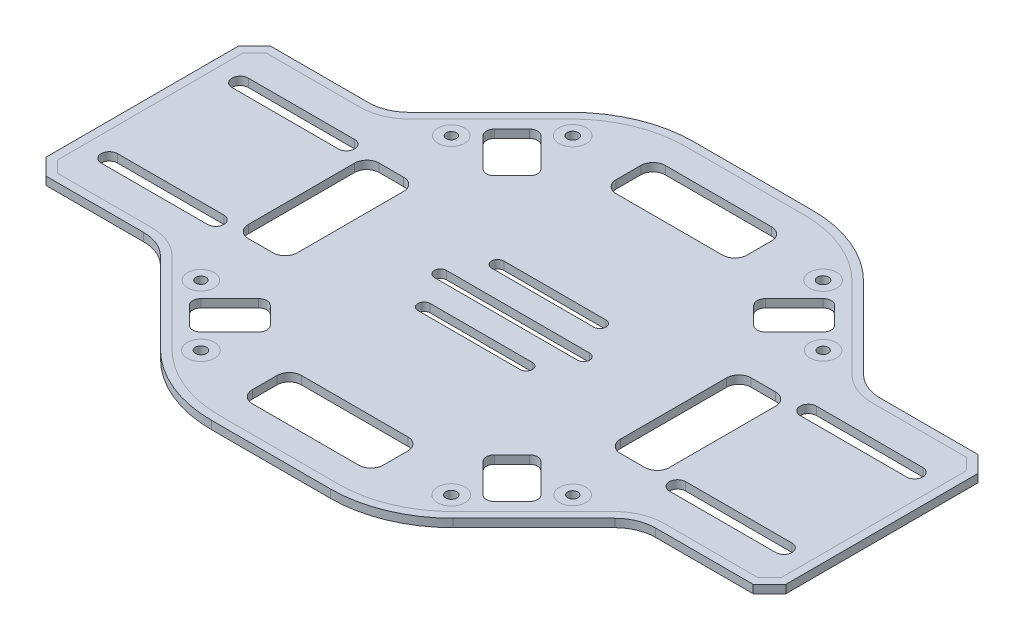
from build123d import *

# Parameters (mm, degrees)
BRUT_DEPTH           = 2
ENCOCHES_DEPTH       = 109.052070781
ENCOCHES_2_DEPTH     = 109.052070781
ESQUISSE4_R          = 1.35
ESQUISSE4_R_2        = 1.25
PASSAGE_DE_VIS_DEPTH = 109.052070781


with BuildPart() as part:
    # Esquisse1 → brut (new body)
    with BuildSketch(Plane(origin=(0, 0, 0), x_dir=(1, 0, 0), z_dir=(0, 1, 0))):
        with BuildLine():
            Line((-14.573593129, 59), (14.573593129, 59))
            ThreePointArc((14.573593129, 59), (26.0540961, 56.716385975), (35.786796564, 50.213203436))
            Line((35.786796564, 50.213203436), (55.571067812, 30.428932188))
            ThreePointArc((55.571067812, 30.428932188), (58.8153013, 28.261204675), (62.642135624, 27.5))
            Line((62.642135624, 27.5), (86.5, 27.5))
            Line((86.5, 27.5), (90.5, 23.5))
            Line((90.5, 23.5), (90.5, -23.5))
            Line((90.5, -23.5), (86.5, -27.5))
            Line((86.5, -27.5), (62.642135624, -27.5))
            ThreePointArc((62.642135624, -27.5), (58.8153013, -28.261204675), (55.571067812, -30.428932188))
            Line((55.571067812, -30.428932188), (35.786796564, -50.213203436))
            ThreePointArc((35.786796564, -50.213203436), (26.0540961, -56.716385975), (14.573593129, -59))
            Line((14.573593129, -59), (-14.573593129, -59))
            ThreePointArc((-14.573593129, -59), (-26.0540961, -56.716385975), (-35.786796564, -50.213203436))
            Line((-35.786796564, -50.213203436), (-55.571067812, -30.428932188))
            ThreePointArc((-55.571067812, -30.428932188), (-58.8153013, -28.261204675), (-62.642135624, -27.5))
            Line((-62.642135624, -27.5), (-86.5, -27.5))
            Line((-86.5, -27.5), (-90.5, -23.5))
            Line((-90.5, -23.5), (-90.5, 23.5))
            Line((-90.5, 23.5), (-86.5, 27.5))
            Line((-86.5, 27.5), (-62.642135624, 27.5))
            ThreePointArc((-62.642135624, 27.5), (-58.8153013, 28.261204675), (-55.571067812, 30.428932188))
            Line((-55.571067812, 30.428932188), (-35.786796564, 50.213203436))
            ThreePointArc((-35.786796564, 50.213203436), (-26.0540961, 56.716385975), (-14.573593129, 59))
        make_face()
    extrude(amount=-BRUT_DEPTH)

    # Esquisse2 → encoches (cut, through all)
    with BuildSketch(Plane.XZ.offset(2)):
        with BuildLine():
            Line((-17.5, 1.5), (17.5, 1.5))
            ThreePointArc((17.5, 1.5), (19, 0), (17.5, -1.5))
            Line((17.5, -1.5), (-17.5, -1.5))
            ThreePointArc((-17.5, -1.5), (-19, 0), (-17.5, 1.5))
        make_face()
        with BuildLine():
            Line((-12.5, 10.5), (12.5, 10.5))
            ThreePointArc((12.5, 10.5), (14, 9), (12.5, 7.5))
            Line((12.5, 7.5), (-12.5, 7.5))
            ThreePointArc((-12.5, 7.5), (-14, 9), (-12.5, 10.5))
        make_face()
        with BuildLine():
            Line((-12.5, -7.5), (12.5, -7.5))
            ThreePointArc((12.5, -7.5), (14, -9), (12.5, -10.5))
            Line((12.5, -10.5), (-12.5, -10.5))
            ThreePointArc((-12.5, -10.5), (-14, -9), (-12.5, -7.5))
        make_face()
        with BuildLine():
            Line((37.343145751, 41.585786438), (41.585786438, 37.343145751))
            ThreePointArc((41.585786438, 37.343145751), (42.171572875, 35.928932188), (41.585786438, 34.514718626))
            Line((41.585786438, 34.514718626), (34.514718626, 27.443650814))
            ThreePointArc((34.514718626, 27.443650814), (33.100505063, 26.857864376), (31.686291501, 27.443650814))
            Line((31.686291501, 27.443650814), (27.443650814, 31.686291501))
            ThreePointArc((27.443650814, 31.686291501), (26.857864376, 33.100505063), (27.443650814, 34.514718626))
            Line((27.443650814, 34.514718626), (34.514718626, 41.585786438))
            ThreePointArc((34.514718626, 41.585786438), (35.928932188, 42.171572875), (37.343145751, 41.585786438))
        make_face()
        with BuildLine():
            Line((-82.5, 18), (-56.5, 18))
            ThreePointArc((-56.5, 18), (-54.5, 16), (-56.5, 14))
            Line((-56.5, 14), (-82.5, 14))
            ThreePointArc((-82.5, 14), (-84.5, 16), (-82.5, 18))
        make_face()
        with BuildLine():
            Line((-13, 50.5), (13, 50.5))
            ThreePointArc((13, 50.5), (15.121320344, 49.621320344), (16, 47.5))
            Line((16, 47.5), (16, 41.5))
            ThreePointArc((16, 41.5), (15.121320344, 39.378679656), (13, 38.5))
            Line((13, 38.5), (-13, 38.5))
            ThreePointArc((-13, 38.5), (-15.121320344, 39.378679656), (-16, 41.5))
            Line((-16, 41.5), (-16, 47.5))
            ThreePointArc((-16, 47.5), (-15.121320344, 49.621320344), (-13, 50.5))
        make_face()
        with BuildLine():
            Line((56.5, 18), (82.5, 18))
            ThreePointArc((82.5, 18), (84.5, 16), (82.5, 14))
            Line((82.5, 14), (56.5, 14))
            ThreePointArc((56.5, 14), (54.5, 16), (56.5, 18))
        make_face()
        with BuildLine():
            Line((-41.585786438, 37.343145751), (-37.343145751, 41.585786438))
            ThreePointArc((-37.343145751, 41.585786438), (-35.928932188, 42.171572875), (-34.514718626, 41.585786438))
            Line((-34.514718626, 41.585786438), (-27.443650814, 34.514718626))
            ThreePointArc((-27.443650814, 34.514718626), (-26.857864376, 33.100505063), (-27.443650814, 31.686291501))
            Line((-27.443650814, 31.686291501), (-31.686291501, 27.443650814))
            ThreePointArc((-31.686291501, 27.443650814), (-33.100505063, 26.857864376), (-34.514718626, 27.443650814))
            Line((-34.514718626, 27.443650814), (-41.585786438, 34.514718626))
            ThreePointArc((-41.585786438, 34.514718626), (-42.171572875, 35.928932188), (-41.585786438, 37.343145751))
        make_face()
        with BuildLine():
            Line((56.5, -14), (82.5, -14))
            ThreePointArc((82.5, -14), (84.5, -16), (82.5, -18))
            Line((82.5, -18), (56.5, -18))
            ThreePointArc((56.5, -18), (54.5, -16), (56.5, -14))
        make_face()
        with BuildLine():
            Line((27.443650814, -34.514718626), (34.514718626, -41.585786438))
            ThreePointArc((34.514718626, -41.585786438), (35.928932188, -42.171572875), (37.343145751, -41.585786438))
            Line((37.343145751, -41.585786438), (41.585786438, -37.343145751))
            ThreePointArc((41.585786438, -37.343145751), (42.171572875, -35.928932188), (41.585786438, -34.514718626))
            Line((41.585786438, -34.514718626), (34.514718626, -27.443650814))
            ThreePointArc((34.514718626, -27.443650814), (33.100505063, -26.857864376), (31.686291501, -27.443650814))
            Line((31.686291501, -27.443650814), (27.443650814, -31.686291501))
            ThreePointArc((27.443650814, -31.686291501), (26.857864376, -33.100505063), (27.443650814, -34.514718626))
        make_face()
        with BuildLine():
            Line((16, -47.5), (16, -41.5))
            ThreePointArc((16, -41.5), (15.121320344, -39.378679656), (13, -38.5))
            Line((13, -38.5), (-13, -38.5))
            ThreePointArc((-13, -38.5), (-15.121320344, -39.378679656), (-16, -41.5))
            Line((-16, -41.5), (-16, -47.5))
            ThreePointArc((-16, -47.5), (-15.121320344, -49.621320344), (-13, -50.5))
            Line((-13, -50.5), (13, -50.5))
            ThreePointArc((13, -50.5), (15.121320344, -49.621320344), (16, -47.5))
        make_face()
        with BuildLine():
            Line((-34.514718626, -27.443650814), (-41.585786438, -34.514718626))
            ThreePointArc((-41.585786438, -34.514718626), (-42.171572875, -35.928932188), (-41.585786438, -37.343145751))
            Line((-41.585786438, -37.343145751), (-37.343145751, -41.585786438))
            ThreePointArc((-37.343145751, -41.585786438), (-35.928932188, -42.171572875), (-34.514718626, -41.585786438))
            Line((-34.514718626, -41.585786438), (-27.443650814, -34.514718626))
            ThreePointArc((-27.443650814, -34.514718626), (-26.857864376, -33.100505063), (-27.443650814, -31.686291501))
            Line((-27.443650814, -31.686291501), (-31.686291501, -27.443650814))
            ThreePointArc((-31.686291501, -27.443650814), (-33.100505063, -26.857864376), (-34.514718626, -27.443650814))
        make_face()
        with BuildLine():
            Line((-82.5, -14), (-56.5, -14))
            ThreePointArc((-56.5, -14), (-54.5, -16), (-56.5, -18))
            Line((-56.5, -18), (-82.5, -18))
            ThreePointArc((-82.5, -18), (-84.5, -16), (-82.5, -14))
        make_face()
    extrude(amount=-ENCOCHES_DEPTH, mode=Mode.SUBTRACT)

    # Esquisse3 → encoches 2 (cut, through all)
    with BuildSketch(Plane.XZ.offset(2)):
        with BuildLine():
            Line((-48.5, 16), (-42.5, 16))
            ThreePointArc((-42.5, 16), (-40.378679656, 15.121320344), (-39.5, 13))
            Line((-39.5, 13), (-39.5, -13))
            ThreePointArc((-39.5, -13), (-40.378679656, -15.121320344), (-42.5, -16))
            Line((-42.5, -16), (-48.5, -16))
            ThreePointArc((-48.5, -16), (-50.621320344, -15.121320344), (-51.5, -13))
            Line((-51.5, -13), (-51.5, 13))
            ThreePointArc((-51.5, 13), (-50.621320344, 15.121320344), (-48.5, 16))
        make_face()
        with BuildLine():
            Line((39.5, 13), (39.5, -13))
            ThreePointArc((39.5, -13), (40.378679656, -15.121320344), (42.5, -16))
            Line((42.5, -16), (48.5, -16))
            ThreePointArc((48.5, -16), (50.621320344, -15.121320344), (51.5, -13))
            Line((51.5, -13), (51.5, 13))
            ThreePointArc((51.5, 13), (50.621320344, 15.121320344), (48.5, 16))
            Line((48.5, 16), (42.5, 16))
            ThreePointArc((42.5, 16), (40.378679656, 15.121320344), (39.5, 13))
        make_face()
    extrude(amount=-ENCOCHES_2_DEPTH, mode=Mode.SUBTRACT)

    # Esquisse4 → passage de vis (cut, through all)
    with BuildSketch(Plane.XZ.offset(2)):
        with Locations(Location((-30.625631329, 45.474873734, 0), (0, 0, 270))):
            Circle(ESQUISSE4_R)
        with Locations(Location((-45.474873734, 30.625631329, 0), (0, 0, 270))):
            Circle(ESQUISSE4_R_2)
        with Locations(Location((45.474873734, 30.625631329, 0), (0, 0, 90))):
            Circle(ESQUISSE4_R_2)
        with Locations(Location((30.625631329, 45.474873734, 0), (0, 0, 90))):
            Circle(ESQUISSE4_R)
        with Locations(Location((30.625631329, -45.474873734, 0), (0, 0, 270))):
            Circle(ESQUISSE4_R)
        with Locations(Location((45.474873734, -30.625631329, 0), (0, 0, 270))):
            Circle(ESQUISSE4_R_2)
        with Locations(Location((-45.474873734, -30.625631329, 0), (0, 0, 90))):
            Circle(ESQUISSE4_R_2)
        with Locations(Location((-30.625631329, -45.474873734, 0), (0, 0, 90))):
            Circle(ESQUISSE4_R)
    extrude(amount=-PASSAGE_DE_VIS_DEPTH, mode=Mode.SUBTRACT)


solid = part.part
